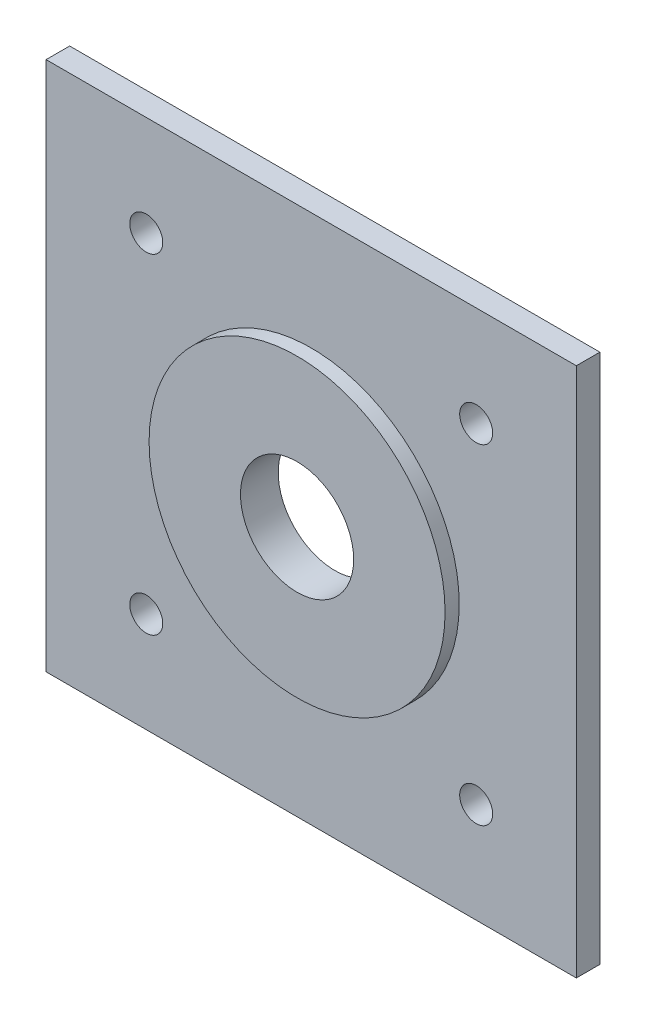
ISO-10303-21;
HEADER;
FILE_DESCRIPTION(('STEP AP214'),'2;1');
FILE_NAME('part.step','',(''),(''),'','','');
FILE_SCHEMA(('AUTOMOTIVE_DESIGN { 1 0 10303 214 1 1 1 1 }'));
ENDSEC;
DATA;
#1=APPLICATION_CONTEXT('core data for automotive mechanical design processes');
#2=APPLICATION_PROTOCOL_DEFINITION('international standard','automotive_design',2000,#1);
#3=PRODUCT_CONTEXT('',#1,'mechanical');
#4=PRODUCT('Part','Part','',(#3));
#5=PRODUCT_RELATED_PRODUCT_CATEGORY('part','',(#4));
#6=PRODUCT_DEFINITION_FORMATION('','',#4);
#7=PRODUCT_DEFINITION_CONTEXT('part definition',#1,'design');
#8=PRODUCT_DEFINITION('design','',#6,#7);
#9=PRODUCT_DEFINITION_SHAPE('','',#8);
#10=(LENGTH_UNIT() NAMED_UNIT(*) SI_UNIT(.MILLI.,.METRE.));
#11=(NAMED_UNIT(*) PLANE_ANGLE_UNIT() SI_UNIT($,.RADIAN.));
#12=(NAMED_UNIT(*) SI_UNIT($,.STERADIAN.) SOLID_ANGLE_UNIT());
#13=UNCERTAINTY_MEASURE_WITH_UNIT(LENGTH_MEASURE(1.E-05),#10,'distance_accuracy_value','');
#14=(GEOMETRIC_REPRESENTATION_CONTEXT(3) GLOBAL_UNCERTAINTY_ASSIGNED_CONTEXT((#13)) GLOBAL_UNIT_ASSIGNED_CONTEXT((#10,
#11,#12)) REPRESENTATION_CONTEXT('',''));
#15=CARTESIAN_POINT('',(0.,0.,0.));
#16=DIRECTION('',(0.,0.,1.));
#17=DIRECTION('',(1.,0.,0.));
#18=AXIS2_PLACEMENT_3D('',#15,#16,#17);
#19=CARTESIAN_POINT('',(56.25,56.25,5.));
#20=DIRECTION('',(-1.,0.,0.));
#21=DIRECTION('',(0.,-1.,0.));
#22=AXIS2_PLACEMENT_3D('',#19,#20,#21);
#23=PLANE('',#22);
#24=DIRECTION('',(0.,1.,0.));
#25=VECTOR('',#24,1.);
#26=CARTESIAN_POINT('',(56.25,56.25,0.));
#27=LINE('',#26,#25);
#28=CARTESIAN_POINT('',(56.25,-56.25,0.));
#29=VERTEX_POINT('',#28);
#30=CARTESIAN_POINT('',(56.25,56.25,0.));
#31=VERTEX_POINT('',#30);
#32=EDGE_CURVE('E101',#29,#31,#27,.T.);
#33=ORIENTED_EDGE('',*,*,#32,.T.);
#34=DIRECTION('',(0.,0.,-1.));
#35=VECTOR('',#34,1.);
#36=CARTESIAN_POINT('',(56.25,56.25,5.));
#37=LINE('',#36,#35);
#38=CARTESIAN_POINT('',(56.25,56.25,5.));
#39=VERTEX_POINT('',#38);
#40=EDGE_CURVE('E11',#39,#31,#37,.T.);
#41=ORIENTED_EDGE('',*,*,#40,.F.);
#42=DIRECTION('',(0.,1.,0.));
#43=VECTOR('',#42,1.);
#44=CARTESIAN_POINT('',(56.25,56.25,5.));
#45=LINE('',#44,#43);
#46=CARTESIAN_POINT('',(56.25,-56.25,5.));
#47=VERTEX_POINT('',#46);
#48=EDGE_CURVE('E88',#47,#39,#45,.T.);
#49=ORIENTED_EDGE('',*,*,#48,.F.);
#50=DIRECTION('',(0.,0.,-1.));
#51=VECTOR('',#50,1.);
#52=CARTESIAN_POINT('',(56.25,-56.25,5.));
#53=LINE('',#52,#51);
#54=EDGE_CURVE('E97',#47,#29,#53,.T.);
#55=ORIENTED_EDGE('',*,*,#54,.T.);
#56=EDGE_LOOP('',(#33,#41,#49,#55));
#57=FACE_BOUND('',#56,.T.);
#58=ADVANCED_FACE('F35',(#57),#23,.F.);
#59=CARTESIAN_POINT('',(-56.25,56.25,5.));
#60=DIRECTION('',(0.,-1.,0.));
#61=DIRECTION('',(0.,0.,-1.));
#62=AXIS2_PLACEMENT_3D('',#59,#60,#61);
#63=PLANE('',#62);
#64=DIRECTION('',(-1.,0.,0.));
#65=VECTOR('',#64,1.);
#66=CARTESIAN_POINT('',(-56.25,56.25,0.));
#67=LINE('',#66,#65);
#68=CARTESIAN_POINT('',(-56.25,56.25,0.));
#69=VERTEX_POINT('',#68);
#70=EDGE_CURVE('E92',#31,#69,#67,.T.);
#71=ORIENTED_EDGE('',*,*,#70,.T.);
#72=DIRECTION('',(0.,0.,-1.));
#73=VECTOR('',#72,1.);
#74=CARTESIAN_POINT('',(-56.25,56.25,5.));
#75=LINE('',#74,#73);
#76=CARTESIAN_POINT('',(-56.25,56.25,5.));
#77=VERTEX_POINT('',#76);
#78=EDGE_CURVE('E44',#77,#69,#75,.T.);
#79=ORIENTED_EDGE('',*,*,#78,.F.);
#80=DIRECTION('',(-1.,0.,0.));
#81=VECTOR('',#80,1.);
#82=CARTESIAN_POINT('',(-56.25,56.25,5.));
#83=LINE('',#82,#81);
#84=EDGE_CURVE('E83',#39,#77,#83,.T.);
#85=ORIENTED_EDGE('',*,*,#84,.F.);
#86=ORIENTED_EDGE('',*,*,#40,.T.);
#87=EDGE_LOOP('',(#71,#79,#85,#86));
#88=FACE_BOUND('',#87,.T.);
#89=ADVANCED_FACE('F91',(#88),#63,.F.);
#90=CARTESIAN_POINT('',(-56.25,56.25,5.));
#91=DIRECTION('',(1.,0.,0.));
#92=DIRECTION('',(0.,1.,0.));
#93=AXIS2_PLACEMENT_3D('',#90,#91,#92);
#94=PLANE('',#93);
#95=DIRECTION('',(0.,-1.,0.));
#96=VECTOR('',#95,1.);
#97=CARTESIAN_POINT('',(-56.25,56.25,0.));
#98=LINE('',#97,#96);
#99=CARTESIAN_POINT('',(-56.25,-56.25,0.));
#100=VERTEX_POINT('',#99);
#101=EDGE_CURVE('E70',#69,#100,#98,.T.);
#102=ORIENTED_EDGE('',*,*,#101,.T.);
#103=DIRECTION('',(0.,0.,-1.));
#104=VECTOR('',#103,1.);
#105=CARTESIAN_POINT('',(-56.25,-56.25,5.));
#106=LINE('',#105,#104);
#107=CARTESIAN_POINT('',(-56.25,-56.25,5.));
#108=VERTEX_POINT('',#107);
#109=EDGE_CURVE('E93',#108,#100,#106,.T.);
#110=ORIENTED_EDGE('',*,*,#109,.F.);
#111=DIRECTION('',(0.,-1.,0.));
#112=VECTOR('',#111,1.);
#113=CARTESIAN_POINT('',(-56.25,56.25,5.));
#114=LINE('',#113,#112);
#115=EDGE_CURVE('E86',#77,#108,#114,.T.);
#116=ORIENTED_EDGE('',*,*,#115,.F.);
#117=ORIENTED_EDGE('',*,*,#78,.T.);
#118=EDGE_LOOP('',(#102,#110,#116,#117));
#119=FACE_BOUND('',#118,.T.);
#120=ADVANCED_FACE('F95',(#119),#94,.F.);
#121=CARTESIAN_POINT('',(-56.25,-56.25,5.));
#122=DIRECTION('',(0.,1.,0.));
#123=DIRECTION('',(0.,0.,1.));
#124=AXIS2_PLACEMENT_3D('',#121,#122,#123);
#125=PLANE('',#124);
#126=DIRECTION('',(1.,0.,0.));
#127=VECTOR('',#126,1.);
#128=CARTESIAN_POINT('',(-56.25,-56.25,0.));
#129=LINE('',#128,#127);
#130=EDGE_CURVE('E76',#100,#29,#129,.T.);
#131=ORIENTED_EDGE('',*,*,#130,.T.);
#132=ORIENTED_EDGE('',*,*,#54,.F.);
#133=DIRECTION('',(1.,0.,0.));
#134=VECTOR('',#133,1.);
#135=CARTESIAN_POINT('',(-56.25,-56.25,5.));
#136=LINE('',#135,#134);
#137=EDGE_CURVE('E53',#108,#47,#136,.T.);
#138=ORIENTED_EDGE('',*,*,#137,.F.);
#139=ORIENTED_EDGE('',*,*,#109,.T.);
#140=EDGE_LOOP('',(#131,#132,#138,#139));
#141=FACE_BOUND('',#140,.T.);
#142=ADVANCED_FACE('F147',(#141),#125,.F.);
#143=CARTESIAN_POINT('',(0.,0.,5.));
#144=DIRECTION('',(0.,0.,1.));
#145=DIRECTION('',(1.,0.,0.));
#146=AXIS2_PLACEMENT_3D('',#143,#144,#145);
#147=PLANE('',#146);
#148=CARTESIAN_POINT('',(35.0000000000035,34.9999999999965,5.));
#149=DIRECTION('',(0.,0.,1.));
#150=DIRECTION('',(1.,0.,0.));
#151=AXIS2_PLACEMENT_3D('',#148,#149,#150);
#152=CIRCLE('',#151,3.49999999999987);
#153=CARTESIAN_POINT('',(38.5000000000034,34.9999999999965,5.));
#154=VERTEX_POINT('',#153);
#155=EDGE_CURVE('E114',#154,#154,#152,.T.);
#156=ORIENTED_EDGE('',*,*,#155,.F.);
#157=EDGE_LOOP('',(#156));
#158=FACE_BOUND('',#157,.T.);
#159=CARTESIAN_POINT('',(35.0000000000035,-34.9999999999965,5.));
#160=DIRECTION('',(0.,0.,1.));
#161=DIRECTION('',(1.,0.,0.));
#162=AXIS2_PLACEMENT_3D('',#159,#160,#161);
#163=CIRCLE('',#162,3.49999999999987);
#164=CARTESIAN_POINT('',(38.5000000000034,-34.9999999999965,5.));
#165=VERTEX_POINT('',#164);
#166=EDGE_CURVE('E121',#165,#165,#163,.T.);
#167=ORIENTED_EDGE('',*,*,#166,.F.);
#168=EDGE_LOOP('',(#167));
#169=FACE_BOUND('',#168,.T.);
#170=CARTESIAN_POINT('',(-34.9999999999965,-34.9999999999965,5.));
#171=DIRECTION('',(0.,0.,1.));
#172=DIRECTION('',(1.,0.,0.));
#173=AXIS2_PLACEMENT_3D('',#170,#171,#172);
#174=CIRCLE('',#173,3.5);
#175=CARTESIAN_POINT('',(-31.4999999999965,-34.9999999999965,5.));
#176=VERTEX_POINT('',#175);
#177=EDGE_CURVE('E117',#176,#176,#174,.T.);
#178=ORIENTED_EDGE('',*,*,#177,.F.);
#179=EDGE_LOOP('',(#178));
#180=FACE_BOUND('',#179,.T.);
#181=CARTESIAN_POINT('',(-34.9999999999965,34.9999999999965,5.));
#182=DIRECTION('',(0.,0.,1.));
#183=DIRECTION('',(1.,0.,0.));
#184=AXIS2_PLACEMENT_3D('',#181,#182,#183);
#185=CIRCLE('',#184,3.5);
#186=CARTESIAN_POINT('',(-31.4999999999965,34.9999999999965,5.));
#187=VERTEX_POINT('',#186);
#188=EDGE_CURVE('E113',#187,#187,#185,.T.);
#189=ORIENTED_EDGE('',*,*,#188,.F.);
#190=EDGE_LOOP('',(#189));
#191=FACE_BOUND('',#190,.T.);
#192=CARTESIAN_POINT('',(0.,0.,5.));
#193=DIRECTION('',(0.,0.,1.));
#194=DIRECTION('',(1.,0.,0.));
#195=AXIS2_PLACEMENT_3D('',#192,#193,#194);
#196=CIRCLE('',#195,31.4);
#197=CARTESIAN_POINT('',(31.4,0.,5.));
#198=VERTEX_POINT('',#197);
#199=EDGE_CURVE('E137',#198,#198,#196,.T.);
#200=ORIENTED_EDGE('',*,*,#199,.F.);
#201=EDGE_LOOP('',(#200));
#202=FACE_BOUND('',#201,.T.);
#203=ORIENTED_EDGE('',*,*,#48,.T.);
#204=ORIENTED_EDGE('',*,*,#84,.T.);
#205=ORIENTED_EDGE('',*,*,#115,.T.);
#206=ORIENTED_EDGE('',*,*,#137,.T.);
#207=EDGE_LOOP('',(#203,#204,#205,#206));
#208=FACE_BOUND('',#207,.T.);
#209=ADVANCED_FACE('F84',(#158,#169,#180,#191,#202,#208),#147,.T.);
#210=CARTESIAN_POINT('',(0.,0.,0.));
#211=DIRECTION('',(0.,0.,1.));
#212=DIRECTION('',(1.,0.,0.));
#213=AXIS2_PLACEMENT_3D('',#210,#211,#212);
#214=PLANE('',#213);
#215=CARTESIAN_POINT('',(0.,0.,0.));
#216=DIRECTION('',(0.,0.,1.));
#217=DIRECTION('',(1.,0.,0.));
#218=AXIS2_PLACEMENT_3D('',#215,#216,#217);
#219=CIRCLE('',#218,12.005);
#220=CARTESIAN_POINT('',(12.005,0.,0.));
#221=VERTEX_POINT('',#220);
#222=EDGE_CURVE('E118',#221,#221,#219,.T.);
#223=ORIENTED_EDGE('',*,*,#222,.T.);
#224=EDGE_LOOP('',(#223));
#225=FACE_BOUND('',#224,.T.);
#226=CARTESIAN_POINT('',(35.0000000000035,34.9999999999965,0.));
#227=DIRECTION('',(0.,0.,1.));
#228=DIRECTION('',(1.,0.,0.));
#229=AXIS2_PLACEMENT_3D('',#226,#227,#228);
#230=CIRCLE('',#229,3.49999999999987);
#231=CARTESIAN_POINT('',(38.5000000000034,34.9999999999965,0.));
#232=VERTEX_POINT('',#231);
#233=EDGE_CURVE('E38',#232,#232,#230,.T.);
#234=ORIENTED_EDGE('',*,*,#233,.T.);
#235=EDGE_LOOP('',(#234));
#236=FACE_BOUND('',#235,.T.);
#237=CARTESIAN_POINT('',(35.0000000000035,-34.9999999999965,0.));
#238=DIRECTION('',(0.,0.,1.));
#239=DIRECTION('',(1.,0.,0.));
#240=AXIS2_PLACEMENT_3D('',#237,#238,#239);
#241=CIRCLE('',#240,3.49999999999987);
#242=CARTESIAN_POINT('',(38.5000000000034,-34.9999999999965,0.));
#243=VERTEX_POINT('',#242);
#244=EDGE_CURVE('E119',#243,#243,#241,.T.);
#245=ORIENTED_EDGE('',*,*,#244,.T.);
#246=EDGE_LOOP('',(#245));
#247=FACE_BOUND('',#246,.T.);
#248=CARTESIAN_POINT('',(-34.9999999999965,-34.9999999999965,0.));
#249=DIRECTION('',(0.,0.,1.));
#250=DIRECTION('',(1.,0.,0.));
#251=AXIS2_PLACEMENT_3D('',#248,#249,#250);
#252=CIRCLE('',#251,3.5);
#253=CARTESIAN_POINT('',(-31.4999999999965,-34.9999999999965,0.));
#254=VERTEX_POINT('',#253);
#255=EDGE_CURVE('E115',#254,#254,#252,.T.);
#256=ORIENTED_EDGE('',*,*,#255,.T.);
#257=EDGE_LOOP('',(#256));
#258=FACE_BOUND('',#257,.T.);
#259=CARTESIAN_POINT('',(-34.9999999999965,34.9999999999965,0.));
#260=DIRECTION('',(0.,0.,1.));
#261=DIRECTION('',(1.,0.,0.));
#262=AXIS2_PLACEMENT_3D('',#259,#260,#261);
#263=CIRCLE('',#262,3.5);
#264=CARTESIAN_POINT('',(-31.4999999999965,34.9999999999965,0.));
#265=VERTEX_POINT('',#264);
#266=EDGE_CURVE('E110',#265,#265,#263,.T.);
#267=ORIENTED_EDGE('',*,*,#266,.T.);
#268=EDGE_LOOP('',(#267));
#269=FACE_BOUND('',#268,.T.);
#270=ORIENTED_EDGE('',*,*,#32,.F.);
#271=ORIENTED_EDGE('',*,*,#130,.F.);
#272=ORIENTED_EDGE('',*,*,#101,.F.);
#273=ORIENTED_EDGE('',*,*,#70,.F.);
#274=EDGE_LOOP('',(#270,#271,#272,#273));
#275=FACE_BOUND('',#274,.T.);
#276=ADVANCED_FACE('F146',(#225,#236,#247,#258,#269,#275),#214,.F.);
#277=CARTESIAN_POINT('',(0.,0.,8.));
#278=DIRECTION('',(0.,0.,-1.));
#279=DIRECTION('',(-1.,0.,0.));
#280=AXIS2_PLACEMENT_3D('',#277,#278,#279);
#281=CYLINDRICAL_SURFACE('',#280,31.4);
#282=CARTESIAN_POINT('',(0.,0.,8.));
#283=DIRECTION('',(0.,0.,1.));
#284=DIRECTION('',(1.,0.,0.));
#285=AXIS2_PLACEMENT_3D('',#282,#283,#284);
#286=CIRCLE('',#285,31.4);
#287=CARTESIAN_POINT('',(31.4,0.,8.));
#288=VERTEX_POINT('',#287);
#289=EDGE_CURVE('E104',#288,#288,#286,.T.);
#290=ORIENTED_EDGE('',*,*,#289,.F.);
#291=EDGE_LOOP('',(#290));
#292=FACE_BOUND('',#291,.T.);
#293=ORIENTED_EDGE('',*,*,#199,.T.);
#294=EDGE_LOOP('',(#293));
#295=FACE_BOUND('',#294,.T.);
#296=ADVANCED_FACE('F143',(#292,#295),#281,.T.);
#297=CARTESIAN_POINT('',(0.,0.,8.));
#298=DIRECTION('',(0.,0.,1.));
#299=DIRECTION('',(1.,0.,0.));
#300=AXIS2_PLACEMENT_3D('',#297,#298,#299);
#301=PLANE('',#300);
#302=CARTESIAN_POINT('',(0.,0.,8.));
#303=DIRECTION('',(0.,0.,1.));
#304=DIRECTION('',(1.,0.,0.));
#305=AXIS2_PLACEMENT_3D('',#302,#303,#304);
#306=CIRCLE('',#305,12.005);
#307=CARTESIAN_POINT('',(12.005,0.,8.));
#308=VERTEX_POINT('',#307);
#309=EDGE_CURVE('E261',#308,#308,#306,.T.);
#310=ORIENTED_EDGE('',*,*,#309,.F.);
#311=EDGE_LOOP('',(#310));
#312=FACE_BOUND('',#311,.T.);
#313=ORIENTED_EDGE('',*,*,#289,.T.);
#314=EDGE_LOOP('',(#313));
#315=FACE_BOUND('',#314,.T.);
#316=ADVANCED_FACE('F186',(#312,#315),#301,.T.);
#317=CARTESIAN_POINT('',(-34.9999999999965,34.9999999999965,-110.));
#318=DIRECTION('',(0.,0.,1.));
#319=DIRECTION('',(1.,0.,0.));
#320=AXIS2_PLACEMENT_3D('',#317,#318,#319);
#321=CYLINDRICAL_SURFACE('',#320,3.5);
#322=ORIENTED_EDGE('',*,*,#188,.T.);
#323=EDGE_LOOP('',(#322));
#324=FACE_BOUND('',#323,.T.);
#325=ORIENTED_EDGE('',*,*,#266,.F.);
#326=EDGE_LOOP('',(#325));
#327=FACE_BOUND('',#326,.T.);
#328=ADVANCED_FACE('F198',(#324,#327),#321,.F.);
#329=CARTESIAN_POINT('',(-34.9999999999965,-34.9999999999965,-110.));
#330=DIRECTION('',(0.,0.,1.));
#331=DIRECTION('',(1.,0.,0.));
#332=AXIS2_PLACEMENT_3D('',#329,#330,#331);
#333=CYLINDRICAL_SURFACE('',#332,3.5);
#334=ORIENTED_EDGE('',*,*,#177,.T.);
#335=EDGE_LOOP('',(#334));
#336=FACE_BOUND('',#335,.T.);
#337=ORIENTED_EDGE('',*,*,#255,.F.);
#338=EDGE_LOOP('',(#337));
#339=FACE_BOUND('',#338,.T.);
#340=ADVANCED_FACE('F203',(#336,#339),#333,.F.);
#341=CARTESIAN_POINT('',(35.0000000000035,-34.9999999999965,-110.));
#342=DIRECTION('',(0.,0.,1.));
#343=DIRECTION('',(1.,0.,0.));
#344=AXIS2_PLACEMENT_3D('',#341,#342,#343);
#345=CYLINDRICAL_SURFACE('',#344,3.49999999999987);
#346=ORIENTED_EDGE('',*,*,#166,.T.);
#347=EDGE_LOOP('',(#346));
#348=FACE_BOUND('',#347,.T.);
#349=ORIENTED_EDGE('',*,*,#244,.F.);
#350=EDGE_LOOP('',(#349));
#351=FACE_BOUND('',#350,.T.);
#352=ADVANCED_FACE('F213',(#348,#351),#345,.F.);
#353=CARTESIAN_POINT('',(35.0000000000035,34.9999999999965,-110.));
#354=DIRECTION('',(0.,0.,1.));
#355=DIRECTION('',(1.,0.,0.));
#356=AXIS2_PLACEMENT_3D('',#353,#354,#355);
#357=CYLINDRICAL_SURFACE('',#356,3.49999999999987);
#358=ORIENTED_EDGE('',*,*,#155,.T.);
#359=EDGE_LOOP('',(#358));
#360=FACE_BOUND('',#359,.T.);
#361=ORIENTED_EDGE('',*,*,#233,.F.);
#362=EDGE_LOOP('',(#361));
#363=FACE_BOUND('',#362,.T.);
#364=ADVANCED_FACE('F222',(#360,#363),#357,.F.);
#365=CARTESIAN_POINT('',(0.,0.,-44.));
#366=DIRECTION('',(0.,0.,1.));
#367=DIRECTION('',(1.,0.,0.));
#368=AXIS2_PLACEMENT_3D('',#365,#366,#367);
#369=CYLINDRICAL_SURFACE('',#368,12.005);
#370=ORIENTED_EDGE('',*,*,#309,.T.);
#371=EDGE_LOOP('',(#370));
#372=FACE_BOUND('',#371,.T.);
#373=ORIENTED_EDGE('',*,*,#222,.F.);
#374=EDGE_LOOP('',(#373));
#375=FACE_BOUND('',#374,.T.);
#376=ADVANCED_FACE('F232',(#372,#375),#369,.F.);
#377=CLOSED_SHELL('',(#58,#89,#120,#142,#209,#276,#296,#316,#328,#340,#352,#364,#376));
#378=MANIFOLD_SOLID_BREP('B2',#377);
#379=ADVANCED_BREP_SHAPE_REPRESENTATION('',(#18,#378),#14);
#380=SHAPE_DEFINITION_REPRESENTATION(#9,#379);
ENDSEC;
END-ISO-10303-21;
